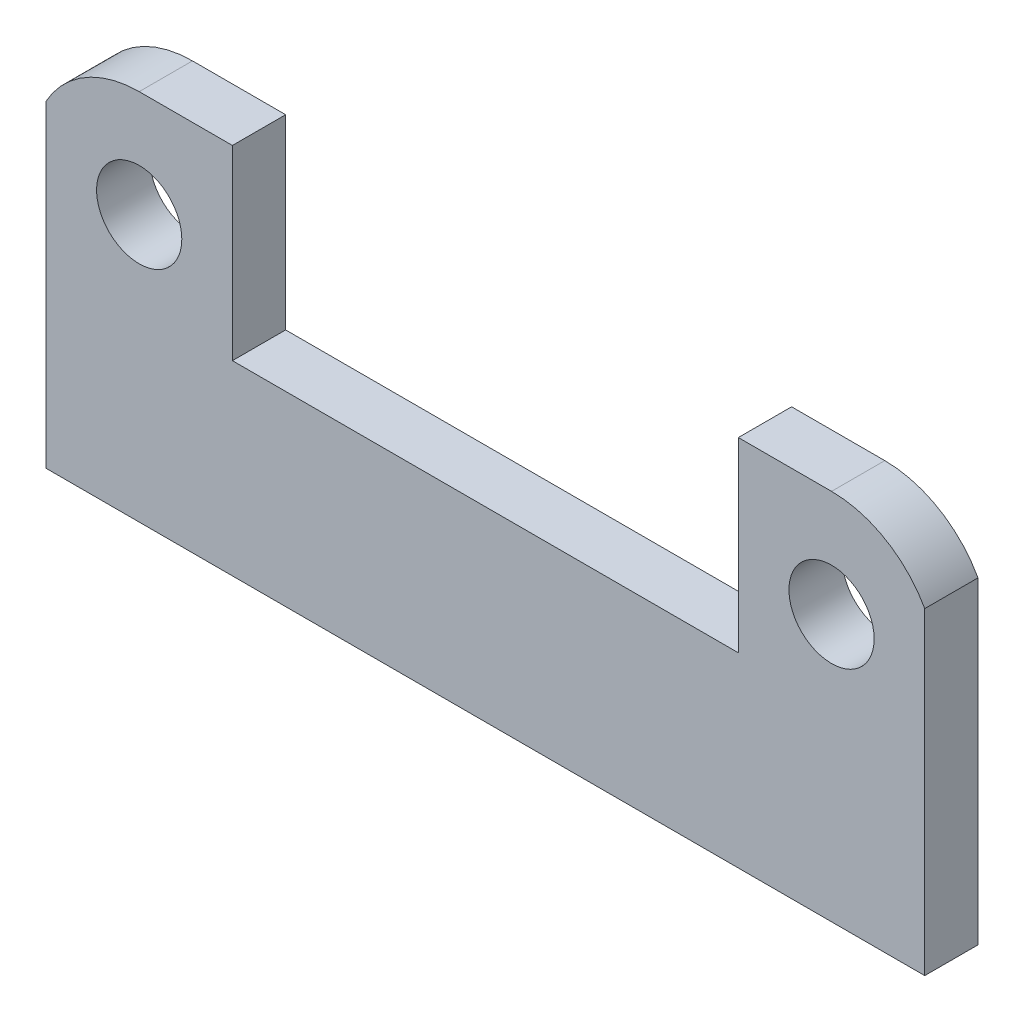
from build123d import *

# Parameters (mm, degrees)
SKETCH_1_R      = 1.6
EXTRUDE_1_DEPTH = 2


with BuildPart() as part:
    # Sketch 1 → Extrude 1 (new body)
    with BuildSketch(Plane.XY):
        with BuildLine():
            ThreePointArc((28.683852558, 20.677630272), (27.215358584, 22.186858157), (25.183852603, 22.741138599))
            Line((25.183852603, 22.741138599), (21.683852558, 22.741138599))
            Line((21.683852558, 22.741138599), (21.683852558, 15.741138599))
            Line((21.683852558, 15.741138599), (2.683852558, 15.741138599))
            Line((2.683852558, 15.741138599), (2.683852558, 22.741138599))
            Line((2.683852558, 22.741138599), (-0.816147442, 22.741138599))
            ThreePointArc((-0.816147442, 22.741138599), (-2.847653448, 22.186858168), (-4.316147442, 20.677630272))
            Line((-4.316147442, 20.677630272), (-4.316147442, 8.741138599))
            Line((-4.316147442, 8.741138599), (28.683852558, 8.741138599))
            Line((28.683852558, 8.741138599), (28.683852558, 20.677630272))
        make_face()
        with Locations((-0.816147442, 18.741138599)):
            Circle(SKETCH_1_R, mode=Mode.SUBTRACT)
        with Locations((25.183852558, 18.741138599)):
            Circle(SKETCH_1_R, mode=Mode.SUBTRACT)
    extrude(amount=EXTRUDE_1_DEPTH)


solid = part.part
